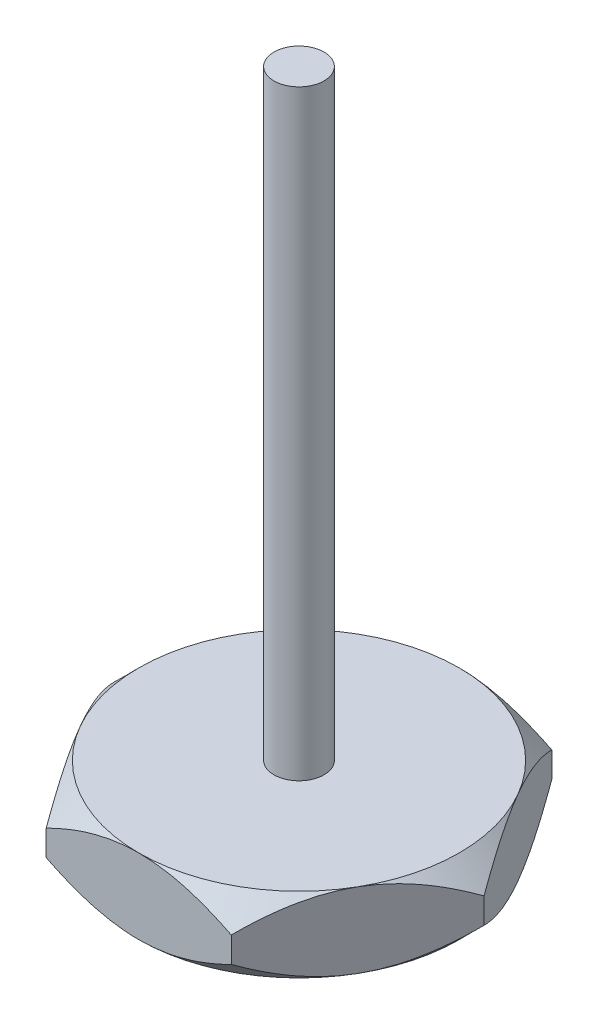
ISO-10303-21;
HEADER;
FILE_DESCRIPTION(('STEP AP214'),'2;1');
FILE_NAME('part.step','',(''),(''),'','','');
FILE_SCHEMA(('AUTOMOTIVE_DESIGN { 1 0 10303 214 1 1 1 1 }'));
ENDSEC;
DATA;
#1=APPLICATION_CONTEXT('core data for automotive mechanical design processes');
#2=APPLICATION_PROTOCOL_DEFINITION('international standard','automotive_design',2000,#1);
#3=PRODUCT_CONTEXT('',#1,'mechanical');
#4=PRODUCT('Part','Part','',(#3));
#5=PRODUCT_RELATED_PRODUCT_CATEGORY('part','',(#4));
#6=PRODUCT_DEFINITION_FORMATION('','',#4);
#7=PRODUCT_DEFINITION_CONTEXT('part definition',#1,'design');
#8=PRODUCT_DEFINITION('design','',#6,#7);
#9=PRODUCT_DEFINITION_SHAPE('','',#8);
#10=(LENGTH_UNIT() NAMED_UNIT(*) SI_UNIT(.MILLI.,.METRE.));
#11=(NAMED_UNIT(*) PLANE_ANGLE_UNIT() SI_UNIT($,.RADIAN.));
#12=(NAMED_UNIT(*) SI_UNIT($,.STERADIAN.) SOLID_ANGLE_UNIT());
#13=UNCERTAINTY_MEASURE_WITH_UNIT(LENGTH_MEASURE(1.E-05),#10,'distance_accuracy_value','');
#14=(GEOMETRIC_REPRESENTATION_CONTEXT(3) GLOBAL_UNCERTAINTY_ASSIGNED_CONTEXT((#13)) GLOBAL_UNIT_ASSIGNED_CONTEXT((#10,
#11,#12)) REPRESENTATION_CONTEXT('',''));
#15=CARTESIAN_POINT('',(0.,0.,0.));
#16=DIRECTION('',(0.,0.,1.));
#17=DIRECTION('',(1.,0.,0.));
#18=AXIS2_PLACEMENT_3D('',#15,#16,#17);
#19=CARTESIAN_POINT('',(4.618802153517,1.875,-8.));
#20=DIRECTION('',(0.,0.,1.));
#21=DIRECTION('',(1.,0.,0.));
#22=AXIS2_PLACEMENT_3D('',#19,#20,#21);
#23=PLANE('',#22);
#24=DIRECTION('',(0.,-1.,0.));
#25=VECTOR('',#24,1.);
#26=CARTESIAN_POINT('',(4.618802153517,1.875,-8.));
#27=LINE('',#26,#25);
#28=CARTESIAN_POINT('',(4.618802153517,0.637395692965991,-8.));
#29=VERTEX_POINT('',#28);
#30=CARTESIAN_POINT('',(4.618802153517,-0.637395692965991,-8.));
#31=VERTEX_POINT('',#30);
#32=EDGE_CURVE('E254',#29,#31,#27,.T.);
#33=ORIENTED_EDGE('',*,*,#32,.T.);
#34=CARTESIAN_POINT('',(14.5887480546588,6.76325621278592,-8.));
#35=CARTESIAN_POINT('',(14.3746791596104,6.57556138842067,-8.));
#36=CARTESIAN_POINT('',(14.1601418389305,6.38840037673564,-8.));
#37=CARTESIAN_POINT('',(13.7300046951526,6.01529729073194,-8.));
#38=CARTESIAN_POINT('',(13.5144048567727,5.8293552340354,-8.));
#39=CARTESIAN_POINT('',(12.865646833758,5.27343359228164,-8.));
#40=CARTESIAN_POINT('',(12.4307136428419,4.90551987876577,-8.));
#41=CARTESIAN_POINT('',(11.5461849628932,4.16967112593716,-8.));
#42=CARTESIAN_POINT('',(11.0964696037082,3.80187951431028,-8.));
#43=CARTESIAN_POINT('',(10.4158587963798,3.25784673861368,-8.));
#44=CARTESIAN_POINT('',(10.1880069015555,3.07779708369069,-8.));
#45=CARTESIAN_POINT('',(9.72996585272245,2.72069873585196,-8.));
#46=CARTESIAN_POINT('',(9.49977673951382,2.54364999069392,-8.));
#47=CARTESIAN_POINT('',(9.03646716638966,2.19292465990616,-8.));
#48=CARTESIAN_POINT('',(8.80334393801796,2.01925172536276,-8.));
#49=CARTESIAN_POINT('',(8.33397268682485,1.67616618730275,-8.));
#50=CARTESIAN_POINT('',(8.09772463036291,1.50675362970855,-8.));
#51=CARTESIAN_POINT('',(7.6214106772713,1.17294130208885,-8.));
#52=CARTESIAN_POINT('',(7.38134177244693,1.00854581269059,-8.));
#53=CARTESIAN_POINT('',(6.89699977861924,0.68605811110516,-8.));
#54=CARTESIAN_POINT('',(6.65272678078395,0.527965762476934,-8.));
#55=CARTESIAN_POINT('',(6.16073953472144,0.220446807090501,-8.));
#56=CARTESIAN_POINT('',(5.91305359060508,0.0709751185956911,-8.));
#57=CARTESIAN_POINT('',(5.41210630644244,-0.218443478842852,-8.));
#58=CARTESIAN_POINT('',(5.1588442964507,-0.358389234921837,-8.));
#59=CARTESIAN_POINT('',(4.64638535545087,-0.626149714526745,-8.));
#60=CARTESIAN_POINT('',(4.38719712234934,-0.753980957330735,-8.));
#61=CARTESIAN_POINT('',(3.86200268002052,-0.994649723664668,-8.));
#62=CARTESIAN_POINT('',(3.59599907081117,-1.10749286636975,-8.));
#63=CARTESIAN_POINT('',(3.05047084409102,-1.31693265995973,-8.));
#64=CARTESIAN_POINT('',(2.77077569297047,-1.41309128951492,-8.));
#65=CARTESIAN_POINT('',(2.20415460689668,-1.58131467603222,-8.));
#66=CARTESIAN_POINT('',(1.91722981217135,-1.65338320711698,-8.));
#67=CARTESIAN_POINT('',(1.33977169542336,-1.76847996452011,-8.));
#68=CARTESIAN_POINT('',(1.04928260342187,-1.81172554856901,-8.));
#69=CARTESIAN_POINT('',(0.465319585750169,-1.86674621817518,-8.));
#70=CARTESIAN_POINT('',(0.171846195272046,-1.87852684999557,-8.));
#71=CARTESIAN_POINT('',(-0.415822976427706,-1.86961316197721,-8.));
#72=CARTESIAN_POINT('',(-0.710016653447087,-1.8487829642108,-8.));
#73=CARTESIAN_POINT('',(-1.29452867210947,-1.77613713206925,-8.));
#74=CARTESIAN_POINT('',(-1.58484610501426,-1.72431435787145,-8.));
#75=CARTESIAN_POINT('',(-2.16150815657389,-1.59293897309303,-8.));
#76=CARTESIAN_POINT('',(-2.44780095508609,-1.51316331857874,-8.));
#77=CARTESIAN_POINT('',(-3.0128630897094,-1.33065876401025,-8.));
#78=CARTESIAN_POINT('',(-3.29163196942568,-1.22792847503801,-8.));
#79=CARTESIAN_POINT('',(-3.88571971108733,-0.986030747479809,-8.));
#80=CARTESIAN_POINT('',(-4.19972130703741,-0.843661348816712,-8.));
#81=CARTESIAN_POINT('',(-4.81844629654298,-0.539865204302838,-8.));
#82=CARTESIAN_POINT('',(-5.12316440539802,-0.378427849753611,-8.));
#83=CARTESIAN_POINT('',(-5.72498623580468,-0.0407063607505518,-8.));
#84=CARTESIAN_POINT('',(-6.02207363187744,0.135606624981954,-8.));
#85=CARTESIAN_POINT('',(-6.60919613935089,0.499411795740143,-8.));
#86=CARTESIAN_POINT('',(-6.89923258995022,0.686901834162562,-8.));
#87=CARTESIAN_POINT('',(-7.47503738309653,1.0716926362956,-8.));
#88=CARTESIAN_POINT('',(-7.76077290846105,1.26904227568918,-8.));
#89=CARTESIAN_POINT('',(-8.32728717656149,1.67072804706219,-8.));
#90=CARTESIAN_POINT('',(-8.6080657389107,1.87506443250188,-8.));
#91=CARTESIAN_POINT('',(-9.16514130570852,2.28909222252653,-8.));
#92=CARTESIAN_POINT('',(-9.44144302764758,2.49877729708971,-8.));
#93=CARTESIAN_POINT('',(-9.99053710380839,2.92267184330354,-8.));
#94=CARTESIAN_POINT('',(-10.2633295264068,3.13688122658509,-8.));
#95=CARTESIAN_POINT('',(-10.8823031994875,3.62982343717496,-8.));
#96=CARTESIAN_POINT('',(-11.2275330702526,3.90974962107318,-8.));
#97=CARTESIAN_POINT('',(-11.9140938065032,4.47448032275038,-8.));
#98=CARTESIAN_POINT('',(-12.2554238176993,4.75928587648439,-8.));
#99=CARTESIAN_POINT('',(-12.9302824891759,5.32894125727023,-8.));
#100=CARTESIAN_POINT('',(-13.2638544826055,5.61373983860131,-8.));
#101=CARTESIAN_POINT('',(-13.9282286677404,6.18636928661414,-8.));
#102=CARTESIAN_POINT('',(-14.2590315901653,6.47419930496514,-8.));
#103=CARTESIAN_POINT('',(-14.5887480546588,6.76325621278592,-8.));
#104=B_SPLINE_CURVE_WITH_KNOTS('',3,(#34,#35,#36,#37,#38,#39,#40,#41,#42,#43,#44,#45,#46,#47,
#48,#49,#50,#51,#52,#53,#54,#55,#56,#57,#58,#59,#60,#61,#62,#63,#64,#65,#66,#67,#68,#69,#70,#71,
#72,#73,#74,#75,#76,#77,#78,#79,#80,#81,#82,#83,#84,#85,#86,#87,#88,#89,#90,#91,#92,#93,#94,#95,
#96,#97,#98,#99,#100,#101,#102,#103),.UNSPECIFIED.,.F.,.F.,(4,2,2,2,2,2,2,2,2,2,2,2,2,2,2,2,2,2,
2,2,2,2,2,2,2,2,2,2,2,2,2,2,2,2,4),(0.,0.854103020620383,1.7082183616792,3.41718202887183,
5.15993769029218,6.03112936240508,6.9023058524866,7.7743773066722,8.64645815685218,
9.51926337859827,10.3920496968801,11.2597561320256,12.1275673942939,12.9941777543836,
13.8604622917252,14.7468593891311,15.6331175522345,16.5126143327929,17.3919560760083,
18.2749714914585,19.1581904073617,20.0486235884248,20.9391106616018,21.9725609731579,
23.0065889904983,24.0426707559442,25.0785541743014,26.1202137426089,27.1619111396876,
28.2024282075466,29.2429249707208,30.5762391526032,31.909840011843,33.2256554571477,
34.5411119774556),.UNSPECIFIED.);
#105=CARTESIAN_POINT('',(0.,-1.875,-8.));
#106=VERTEX_POINT('',#105);
#107=EDGE_CURVE('E57',#31,#106,#104,.T.);
#108=ORIENTED_EDGE('',*,*,#107,.T.);
#109=CARTESIAN_POINT('',(-4.618802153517,-0.637395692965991,-8.));
#110=VERTEX_POINT('',#109);
#111=EDGE_CURVE('E192',#106,#110,#104,.T.);
#112=ORIENTED_EDGE('',*,*,#111,.T.);
#113=DIRECTION('',(0.,-1.,0.));
#114=VECTOR('',#113,1.);
#115=CARTESIAN_POINT('',(-4.618802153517,1.875,-8.));
#116=LINE('',#115,#114);
#117=CARTESIAN_POINT('',(-4.618802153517,0.637395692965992,-8.));
#118=VERTEX_POINT('',#117);
#119=EDGE_CURVE('E266',#118,#110,#116,.T.);
#120=ORIENTED_EDGE('',*,*,#119,.F.);
#121=CARTESIAN_POINT('',(14.5887480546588,-6.76325621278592,-8.));
#122=CARTESIAN_POINT('',(14.3746791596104,-6.57556138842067,-8.));
#123=CARTESIAN_POINT('',(14.1601418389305,-6.38840037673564,-8.));
#124=CARTESIAN_POINT('',(13.7300046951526,-6.01529729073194,-8.));
#125=CARTESIAN_POINT('',(13.5144048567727,-5.8293552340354,-8.));
#126=CARTESIAN_POINT('',(12.865646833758,-5.27343359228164,-8.));
#127=CARTESIAN_POINT('',(12.4307136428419,-4.90551987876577,-8.));
#128=CARTESIAN_POINT('',(11.5461849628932,-4.16967112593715,-8.));
#129=CARTESIAN_POINT('',(11.0964696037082,-3.80187951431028,-8.));
#130=CARTESIAN_POINT('',(10.4158587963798,-3.25784673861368,-8.));
#131=CARTESIAN_POINT('',(10.1880069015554,-3.07779708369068,-8.));
#132=CARTESIAN_POINT('',(9.72996585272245,-2.72069873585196,-8.));
#133=CARTESIAN_POINT('',(9.49977673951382,-2.54364999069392,-8.));
#134=CARTESIAN_POINT('',(9.03646716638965,-2.19292465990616,-8.));
#135=CARTESIAN_POINT('',(8.80334393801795,-2.01925172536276,-8.));
#136=CARTESIAN_POINT('',(8.33397268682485,-1.67616618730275,-8.));
#137=CARTESIAN_POINT('',(8.09772463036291,-1.50675362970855,-8.));
#138=CARTESIAN_POINT('',(7.62141067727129,-1.17294130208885,-8.));
#139=CARTESIAN_POINT('',(7.38134177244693,-1.00854581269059,-8.));
#140=CARTESIAN_POINT('',(6.89699977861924,-0.686058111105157,-8.));
#141=CARTESIAN_POINT('',(6.65272678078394,-0.527965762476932,-8.));
#142=CARTESIAN_POINT('',(6.16073953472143,-0.220446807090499,-8.));
#143=CARTESIAN_POINT('',(5.91305359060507,-0.0709751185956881,-8.));
#144=CARTESIAN_POINT('',(5.41210630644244,0.218443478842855,-8.));
#145=CARTESIAN_POINT('',(5.15884429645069,0.35838923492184,-8.));
#146=CARTESIAN_POINT('',(4.64638535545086,0.626149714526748,-8.));
#147=CARTESIAN_POINT('',(4.38719712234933,0.753980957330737,-8.));
#148=CARTESIAN_POINT('',(3.86200268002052,0.99464972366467,-8.));
#149=CARTESIAN_POINT('',(3.59599907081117,1.10749286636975,-8.));
#150=CARTESIAN_POINT('',(3.05047084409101,1.31693265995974,-8.));
#151=CARTESIAN_POINT('',(2.77077569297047,1.41309128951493,-8.));
#152=CARTESIAN_POINT('',(2.20415460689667,1.58131467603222,-8.));
#153=CARTESIAN_POINT('',(1.91722981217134,1.65338320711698,-8.));
#154=CARTESIAN_POINT('',(1.33977169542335,1.76847996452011,-8.));
#155=CARTESIAN_POINT('',(1.04928260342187,1.81172554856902,-8.));
#156=CARTESIAN_POINT('',(0.465319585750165,1.86674621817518,-8.));
#157=CARTESIAN_POINT('',(0.171846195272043,1.87852684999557,-8.));
#158=CARTESIAN_POINT('',(-0.41582297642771,1.86961316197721,-8.));
#159=CARTESIAN_POINT('',(-0.71001665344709,1.8487829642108,-8.));
#160=CARTESIAN_POINT('',(-1.29452867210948,1.77613713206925,-8.));
#161=CARTESIAN_POINT('',(-1.58484610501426,1.72431435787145,-8.));
#162=CARTESIAN_POINT('',(-2.16150815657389,1.59293897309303,-8.));
#163=CARTESIAN_POINT('',(-2.44780095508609,1.51316331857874,-8.));
#164=CARTESIAN_POINT('',(-3.0128630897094,1.33065876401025,-8.));
#165=CARTESIAN_POINT('',(-3.29163196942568,1.22792847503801,-8.));
#166=CARTESIAN_POINT('',(-3.88571971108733,0.98603074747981,-8.));
#167=CARTESIAN_POINT('',(-4.19972130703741,0.843661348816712,-8.));
#168=CARTESIAN_POINT('',(-4.81844629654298,0.539865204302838,-8.));
#169=CARTESIAN_POINT('',(-5.12316440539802,0.37842784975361,-8.));
#170=CARTESIAN_POINT('',(-5.72498623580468,0.0407063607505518,-8.));
#171=CARTESIAN_POINT('',(-6.02207363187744,-0.135606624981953,-8.));
#172=CARTESIAN_POINT('',(-6.60919613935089,-0.499411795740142,-8.));
#173=CARTESIAN_POINT('',(-6.89923258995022,-0.686901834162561,-8.));
#174=CARTESIAN_POINT('',(-7.47503738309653,-1.0716926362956,-8.));
#175=CARTESIAN_POINT('',(-7.76077290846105,-1.26904227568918,-8.));
#176=CARTESIAN_POINT('',(-8.32728717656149,-1.67072804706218,-8.));
#177=CARTESIAN_POINT('',(-8.6080657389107,-1.87506443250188,-8.));
#178=CARTESIAN_POINT('',(-9.16514130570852,-2.28909222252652,-8.));
#179=CARTESIAN_POINT('',(-9.44144302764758,-2.49877729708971,-8.));
#180=CARTESIAN_POINT('',(-9.99053710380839,-2.92267184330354,-8.));
#181=CARTESIAN_POINT('',(-10.2633295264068,-3.13688122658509,-8.));
#182=CARTESIAN_POINT('',(-10.8823031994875,-3.62982343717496,-8.));
#183=CARTESIAN_POINT('',(-11.2275330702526,-3.90974962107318,-8.));
#184=CARTESIAN_POINT('',(-11.9140938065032,-4.47448032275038,-8.));
#185=CARTESIAN_POINT('',(-12.2554238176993,-4.75928587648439,-8.));
#186=CARTESIAN_POINT('',(-12.9302824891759,-5.32894125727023,-8.));
#187=CARTESIAN_POINT('',(-13.2638544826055,-5.61373983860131,-8.));
#188=CARTESIAN_POINT('',(-13.9282286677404,-6.18636928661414,-8.));
#189=CARTESIAN_POINT('',(-14.2590315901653,-6.47419930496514,-8.));
#190=CARTESIAN_POINT('',(-14.5887480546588,-6.76325621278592,-8.));
#191=B_SPLINE_CURVE_WITH_KNOTS('',3,(#121,#122,#123,#124,#125,#126,#127,#128,#129,#130,#131,
#132,#133,#134,#135,#136,#137,#138,#139,#140,#141,#142,#143,#144,#145,#146,#147,#148,#149,#150,
#151,#152,#153,#154,#155,#156,#157,#158,#159,#160,#161,#162,#163,#164,#165,#166,#167,#168,#169,
#170,#171,#172,#173,#174,#175,#176,#177,#178,#179,#180,#181,#182,#183,#184,#185,#186,#187,#188,
#189,#190),.UNSPECIFIED.,.F.,.F.,(4,2,2,2,2,2,2,2,2,2,2,2,2,2,2,2,2,2,2,2,2,2,2,2,2,2,2,2,2,2,2,
2,2,2,4),(0.,0.854103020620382,1.7082183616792,3.41718202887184,5.15993769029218,
6.03112936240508,6.90230585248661,7.7743773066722,8.64645815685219,9.51926337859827,
10.3920496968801,11.2597561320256,12.1275673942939,12.9941777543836,13.8604622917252,
14.7468593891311,15.6331175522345,16.5126143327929,17.3919560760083,18.2749714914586,
19.1581904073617,20.0486235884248,20.9391106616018,21.9725609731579,23.0065889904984,
24.0426707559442,25.0785541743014,26.1202137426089,27.1619111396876,28.2024282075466,
29.2429249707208,30.5762391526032,31.909840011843,33.2256554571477,34.5411119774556),.UNSPECIFIED.);
#192=CARTESIAN_POINT('',(0.,1.875,-8.));
#193=VERTEX_POINT('',#192);
#194=EDGE_CURVE('E247',#193,#118,#191,.T.);
#195=ORIENTED_EDGE('',*,*,#194,.F.);
#196=EDGE_CURVE('E253',#29,#193,#191,.T.);
#197=ORIENTED_EDGE('',*,*,#196,.F.);
#198=EDGE_LOOP('',(#33,#108,#112,#120,#195,#197));
#199=FACE_BOUND('',#198,.T.);
#200=ADVANCED_FACE('F35',(#199),#23,.F.);
#201=CARTESIAN_POINT('',(-4.618802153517,1.875,-8.));
#202=DIRECTION('',(0.866025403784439,0.,0.5));
#203=DIRECTION('',(0.5,0.,-0.866025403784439));
#204=AXIS2_PLACEMENT_3D('',#201,#202,#203);
#205=PLANE('',#204);
#206=ORIENTED_EDGE('',*,*,#119,.T.);
#207=CARTESIAN_POINT('',(-4.61868668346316,-0.637280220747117,-8.0002));
#208=CARTESIAN_POINT('',(-4.6981028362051,-0.716687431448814,-7.86264718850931));
#209=CARTESIAN_POINT('',(-4.77812941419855,-0.793657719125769,-7.72403708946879));
#210=CARTESIAN_POINT('',(-4.93952317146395,-0.941983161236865,-7.44449490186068));
#211=CARTESIAN_POINT('',(-5.02089105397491,-1.01333524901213,-7.30356159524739));
#212=CARTESIAN_POINT('',(-5.26794216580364,-1.21846070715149,-6.87565651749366));
#213=CARTESIAN_POINT('',(-5.43571676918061,-1.34242824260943,-6.58506238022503));
#214=CARTESIAN_POINT('',(-5.77404764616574,-1.5547139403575,-5.99905611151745));
#215=CARTESIAN_POINT('',(-5.94451745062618,-1.6435669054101,-5.70379374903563));
#216=CARTESIAN_POINT('',(-6.2030246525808,-1.74634783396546,-5.25604614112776));
#217=CARTESIAN_POINT('',(-6.28957430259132,-1.77551131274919,-5.10613774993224));
#218=CARTESIAN_POINT('',(-6.46340640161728,-1.82301217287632,-4.80505172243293));
#219=CARTESIAN_POINT('',(-6.55068873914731,-1.84135117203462,-4.65387427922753));
#220=CARTESIAN_POINT('',(-6.76338552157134,-1.87209931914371,-4.2854726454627));
#221=CARTESIAN_POINT('',(-6.88902914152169,-1.87855065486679,-4.06785151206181));
#222=CARTESIAN_POINT('',(-7.14008990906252,-1.8677210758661,-3.63300150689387));
#223=CARTESIAN_POINT('',(-7.26550696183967,-1.85043184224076,-3.41577279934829));
#224=CARTESIAN_POINT('',(-7.51515863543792,-1.79314025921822,-2.98336341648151));
#225=CARTESIAN_POINT('',(-7.63939177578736,-1.75311251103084,-2.76818530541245));
#226=CARTESIAN_POINT('',(-7.8857227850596,-1.65252005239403,-2.34152748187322));
#227=CARTESIAN_POINT('',(-8.00782081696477,-1.59195691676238,-2.13004748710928));
#228=CARTESIAN_POINT('',(-8.22456323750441,-1.4673620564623,-1.75463860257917));
#229=CARTESIAN_POINT('',(-8.31968762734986,-1.40660757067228,-1.58987832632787));
#230=CARTESIAN_POINT('',(-8.50822887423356,-1.27530853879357,-1.2633153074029));
#231=CARTESIAN_POINT('',(-8.60164567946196,-1.20476369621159,-1.10151265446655));
#232=CARTESIAN_POINT('',(-8.78647752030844,-1.05546522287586,-0.781374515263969));
#233=CARTESIAN_POINT('',(-8.87789781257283,-0.976737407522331,-0.623029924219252));
#234=CARTESIAN_POINT('',(-9.05904561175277,-0.812106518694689,-0.30927273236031));
#235=CARTESIAN_POINT('',(-9.14877411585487,-0.726207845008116,-0.153858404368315));
#236=CARTESIAN_POINT('',(-9.23771977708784,-0.637280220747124,0.000200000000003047));
#237=B_SPLINE_CURVE_WITH_KNOTS('',3,(#207,#208,#209,#210,#211,#212,#213,#214,#215,#216,#217,
#218,#219,#220,#221,#222,#223,#224,#225,#226,#227,#228,#229,#230,#231,#232,#233,#234,#235,#236),
.UNSPECIFIED.,.F.,.F.,(4,2,2,2,2,2,2,2,2,2,2,2,2,2,4),(0.,0.532696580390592,1.06568194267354,
2.13740664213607,3.19211397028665,3.71843331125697,4.24467396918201,4.99761238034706,
5.75081469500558,6.50485999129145,7.25884747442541,7.85770857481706,8.4565878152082,
9.05363199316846,9.65031250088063),.UNSPECIFIED.);
#238=CARTESIAN_POINT('',(-6.92820323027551,-1.875,-3.99999999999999));
#239=VERTEX_POINT('',#238);
#240=EDGE_CURVE('E352',#110,#239,#237,.T.);
#241=ORIENTED_EDGE('',*,*,#240,.T.);
#242=CARTESIAN_POINT('',(-9.237604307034,-0.637395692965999,0.));
#243=VERTEX_POINT('',#242);
#244=EDGE_CURVE('E210',#239,#243,#237,.T.);
#245=ORIENTED_EDGE('',*,*,#244,.T.);
#246=DIRECTION('',(0.,-1.,0.));
#247=VECTOR('',#246,1.);
#248=CARTESIAN_POINT('',(-9.237604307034,1.875,0.));
#249=LINE('',#248,#247);
#250=CARTESIAN_POINT('',(-9.237604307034,0.637395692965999,0.));
#251=VERTEX_POINT('',#250);
#252=EDGE_CURVE('E263',#251,#243,#249,.T.);
#253=ORIENTED_EDGE('',*,*,#252,.F.);
#254=CARTESIAN_POINT('',(-4.61868668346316,0.637280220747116,-8.0002));
#255=CARTESIAN_POINT('',(-4.6981028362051,0.716687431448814,-7.86264718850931));
#256=CARTESIAN_POINT('',(-4.77812941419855,0.793657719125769,-7.72403708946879));
#257=CARTESIAN_POINT('',(-4.93952317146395,0.941983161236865,-7.44449490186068));
#258=CARTESIAN_POINT('',(-5.02089105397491,1.01333524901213,-7.30356159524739));
#259=CARTESIAN_POINT('',(-5.26794216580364,1.21846070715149,-6.87565651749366));
#260=CARTESIAN_POINT('',(-5.43571676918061,1.34242824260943,-6.58506238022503));
#261=CARTESIAN_POINT('',(-5.77404764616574,1.5547139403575,-5.99905611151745));
#262=CARTESIAN_POINT('',(-5.94451745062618,1.6435669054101,-5.70379374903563));
#263=CARTESIAN_POINT('',(-6.2030246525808,1.74634783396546,-5.25604614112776));
#264=CARTESIAN_POINT('',(-6.28957430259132,1.77551131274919,-5.10613774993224));
#265=CARTESIAN_POINT('',(-6.46340640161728,1.82301217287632,-4.80505172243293));
#266=CARTESIAN_POINT('',(-6.55068873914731,1.84135117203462,-4.65387427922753));
#267=CARTESIAN_POINT('',(-6.76338552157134,1.87209931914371,-4.2854726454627));
#268=CARTESIAN_POINT('',(-6.88902914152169,1.87855065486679,-4.06785151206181));
#269=CARTESIAN_POINT('',(-7.14008990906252,1.8677210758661,-3.63300150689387));
#270=CARTESIAN_POINT('',(-7.26550696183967,1.85043184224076,-3.41577279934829));
#271=CARTESIAN_POINT('',(-7.51515863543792,1.79314025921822,-2.98336341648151));
#272=CARTESIAN_POINT('',(-7.63939177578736,1.75311251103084,-2.76818530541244));
#273=CARTESIAN_POINT('',(-7.8857227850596,1.65252005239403,-2.34152748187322));
#274=CARTESIAN_POINT('',(-8.00782081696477,1.59195691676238,-2.13004748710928));
#275=CARTESIAN_POINT('',(-8.22456323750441,1.4673620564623,-1.75463860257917));
#276=CARTESIAN_POINT('',(-8.31968762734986,1.40660757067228,-1.58987832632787));
#277=CARTESIAN_POINT('',(-8.50822887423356,1.27530853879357,-1.2633153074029));
#278=CARTESIAN_POINT('',(-8.60164567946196,1.20476369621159,-1.10151265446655));
#279=CARTESIAN_POINT('',(-8.78647752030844,1.05546522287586,-0.78137451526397));
#280=CARTESIAN_POINT('',(-8.87789781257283,0.97673740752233,-0.623029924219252));
#281=CARTESIAN_POINT('',(-9.05904561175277,0.812106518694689,-0.30927273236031));
#282=CARTESIAN_POINT('',(-9.14877411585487,0.726207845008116,-0.153858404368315));
#283=CARTESIAN_POINT('',(-9.23771977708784,0.637280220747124,0.000200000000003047));
#284=B_SPLINE_CURVE_WITH_KNOTS('',3,(#254,#255,#256,#257,#258,#259,#260,#261,#262,#263,#264,
#265,#266,#267,#268,#269,#270,#271,#272,#273,#274,#275,#276,#277,#278,#279,#280,#281,#282,#283),
.UNSPECIFIED.,.F.,.F.,(4,2,2,2,2,2,2,2,2,2,2,2,2,2,4),(0.,0.532696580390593,1.06568194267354,
2.13740664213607,3.19211397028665,3.71843331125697,4.24467396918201,4.99761238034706,
5.75081469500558,6.50485999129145,7.25884747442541,7.85770857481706,8.4565878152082,
9.05363199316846,9.65031250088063),.UNSPECIFIED.);
#285=CARTESIAN_POINT('',(-6.92820323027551,1.875,-3.99999999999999));
#286=VERTEX_POINT('',#285);
#287=EDGE_CURVE('E240',#286,#251,#284,.T.);
#288=ORIENTED_EDGE('',*,*,#287,.F.);
#289=EDGE_CURVE('E246',#118,#286,#284,.T.);
#290=ORIENTED_EDGE('',*,*,#289,.F.);
#291=EDGE_LOOP('',(#206,#241,#245,#253,#288,#290));
#292=FACE_BOUND('',#291,.T.);
#293=ADVANCED_FACE('F219',(#292),#205,.F.);
#294=CARTESIAN_POINT('',(-9.237604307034,1.875,0.));
#295=DIRECTION('',(0.866025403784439,0.,-0.5));
#296=DIRECTION('',(-0.5,0.,-0.866025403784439));
#297=AXIS2_PLACEMENT_3D('',#294,#295,#296);
#298=PLANE('',#297);
#299=ORIENTED_EDGE('',*,*,#252,.T.);
#300=CARTESIAN_POINT('',(-9.23771977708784,-0.637280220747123,-0.000199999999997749));
#301=CARTESIAN_POINT('',(-9.15830362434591,-0.71668743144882,0.137352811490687));
#302=CARTESIAN_POINT('',(-9.07827704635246,-0.793657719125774,0.275962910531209));
#303=CARTESIAN_POINT('',(-8.91688328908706,-0.94198316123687,0.555505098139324));
#304=CARTESIAN_POINT('',(-8.8355154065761,-1.01333524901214,0.696438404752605));
#305=CARTESIAN_POINT('',(-8.58846429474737,-1.2184607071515,1.12434348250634));
#306=CARTESIAN_POINT('',(-8.4206896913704,-1.34242824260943,1.41493761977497));
#307=CARTESIAN_POINT('',(-8.08235881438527,-1.5547139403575,2.00094388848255));
#308=CARTESIAN_POINT('',(-7.91188900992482,-1.64356690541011,2.29620625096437));
#309=CARTESIAN_POINT('',(-7.65338180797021,-1.74634783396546,2.74395385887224));
#310=CARTESIAN_POINT('',(-7.56683215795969,-1.77551131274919,2.89386225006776));
#311=CARTESIAN_POINT('',(-7.39300005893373,-1.82301217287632,3.19494827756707));
#312=CARTESIAN_POINT('',(-7.3057177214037,-1.84135117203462,3.34612572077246));
#313=CARTESIAN_POINT('',(-7.09302093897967,-1.87209931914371,3.7145273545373));
#314=CARTESIAN_POINT('',(-6.96737731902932,-1.87855065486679,3.93214848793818));
#315=CARTESIAN_POINT('',(-6.71631655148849,-1.8677210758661,4.36699849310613));
#316=CARTESIAN_POINT('',(-6.59089949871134,-1.85043184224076,4.5842272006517));
#317=CARTESIAN_POINT('',(-6.34124782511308,-1.79314025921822,5.01663658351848));
#318=CARTESIAN_POINT('',(-6.21701468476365,-1.75311251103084,5.23181469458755));
#319=CARTESIAN_POINT('',(-5.97068367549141,-1.65252005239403,5.65847251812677));
#320=CARTESIAN_POINT('',(-5.84858564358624,-1.59195691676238,5.86995251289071));
#321=CARTESIAN_POINT('',(-5.6318432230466,-1.4673620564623,6.24536139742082));
#322=CARTESIAN_POINT('',(-5.53671883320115,-1.40660757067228,6.41012167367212));
#323=CARTESIAN_POINT('',(-5.34817758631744,-1.27530853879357,6.73668469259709));
#324=CARTESIAN_POINT('',(-5.25476078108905,-1.20476369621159,6.89848734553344));
#325=CARTESIAN_POINT('',(-5.06992894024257,-1.05546522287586,7.21862548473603));
#326=CARTESIAN_POINT('',(-4.97850864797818,-0.976737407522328,7.37697007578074));
#327=CARTESIAN_POINT('',(-4.79736084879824,-0.812106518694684,7.69072726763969));
#328=CARTESIAN_POINT('',(-4.70763234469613,-0.72620784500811,7.84614159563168));
#329=CARTESIAN_POINT('',(-4.61868668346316,-0.637280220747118,8.0002));
#330=B_SPLINE_CURVE_WITH_KNOTS('',3,(#300,#301,#302,#303,#304,#305,#306,#307,#308,#309,#310,
#311,#312,#313,#314,#315,#316,#317,#318,#319,#320,#321,#322,#323,#324,#325,#326,#327,#328,#329),
.UNSPECIFIED.,.F.,.F.,(4,2,2,2,2,2,2,2,2,2,2,2,2,2,4),(0.,0.532696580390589,1.06568194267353,
2.13740664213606,3.19211397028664,3.71843331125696,4.244673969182,4.99761238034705,
5.75081469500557,6.50485999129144,7.2588474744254,7.85770857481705,8.4565878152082,
9.05363199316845,9.65031250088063),.UNSPECIFIED.);
#331=CARTESIAN_POINT('',(-6.92820323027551,-1.875,4.));
#332=VERTEX_POINT('',#331);
#333=EDGE_CURVE('E209',#243,#332,#330,.T.);
#334=ORIENTED_EDGE('',*,*,#333,.T.);
#335=CARTESIAN_POINT('',(-4.618802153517,-0.637395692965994,8.));
#336=VERTEX_POINT('',#335);
#337=EDGE_CURVE('E202',#332,#336,#330,.T.);
#338=ORIENTED_EDGE('',*,*,#337,.T.);
#339=DIRECTION('',(0.,-1.,0.));
#340=VECTOR('',#339,1.);
#341=CARTESIAN_POINT('',(-4.618802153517,1.875,8.));
#342=LINE('',#341,#340);
#343=CARTESIAN_POINT('',(-4.618802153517,0.637395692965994,8.));
#344=VERTEX_POINT('',#343);
#345=EDGE_CURVE('E260',#344,#336,#342,.T.);
#346=ORIENTED_EDGE('',*,*,#345,.F.);
#347=CARTESIAN_POINT('',(-9.23771977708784,0.637280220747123,-0.000199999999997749));
#348=CARTESIAN_POINT('',(-9.15830362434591,0.71668743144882,0.137352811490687));
#349=CARTESIAN_POINT('',(-9.07827704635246,0.793657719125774,0.275962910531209));
#350=CARTESIAN_POINT('',(-8.91688328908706,0.94198316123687,0.555505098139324));
#351=CARTESIAN_POINT('',(-8.8355154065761,1.01333524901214,0.696438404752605));
#352=CARTESIAN_POINT('',(-8.58846429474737,1.2184607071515,1.12434348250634));
#353=CARTESIAN_POINT('',(-8.4206896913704,1.34242824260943,1.41493761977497));
#354=CARTESIAN_POINT('',(-8.08235881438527,1.5547139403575,2.00094388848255));
#355=CARTESIAN_POINT('',(-7.91188900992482,1.64356690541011,2.29620625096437));
#356=CARTESIAN_POINT('',(-7.65338180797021,1.74634783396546,2.74395385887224));
#357=CARTESIAN_POINT('',(-7.56683215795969,1.77551131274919,2.89386225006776));
#358=CARTESIAN_POINT('',(-7.39300005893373,1.82301217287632,3.19494827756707));
#359=CARTESIAN_POINT('',(-7.3057177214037,1.84135117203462,3.34612572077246));
#360=CARTESIAN_POINT('',(-7.09302093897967,1.87209931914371,3.7145273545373));
#361=CARTESIAN_POINT('',(-6.96737731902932,1.87855065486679,3.93214848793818));
#362=CARTESIAN_POINT('',(-6.71631655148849,1.8677210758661,4.36699849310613));
#363=CARTESIAN_POINT('',(-6.59089949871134,1.85043184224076,4.5842272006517));
#364=CARTESIAN_POINT('',(-6.34124782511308,1.79314025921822,5.01663658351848));
#365=CARTESIAN_POINT('',(-6.21701468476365,1.75311251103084,5.23181469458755));
#366=CARTESIAN_POINT('',(-5.97068367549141,1.65252005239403,5.65847251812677));
#367=CARTESIAN_POINT('',(-5.84858564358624,1.59195691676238,5.86995251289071));
#368=CARTESIAN_POINT('',(-5.6318432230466,1.4673620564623,6.24536139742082));
#369=CARTESIAN_POINT('',(-5.53671883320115,1.40660757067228,6.41012167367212));
#370=CARTESIAN_POINT('',(-5.34817758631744,1.27530853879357,6.73668469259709));
#371=CARTESIAN_POINT('',(-5.25476078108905,1.20476369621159,6.89848734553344));
#372=CARTESIAN_POINT('',(-5.06992894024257,1.05546522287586,7.21862548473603));
#373=CARTESIAN_POINT('',(-4.97850864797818,0.976737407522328,7.37697007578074));
#374=CARTESIAN_POINT('',(-4.79736084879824,0.812106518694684,7.69072726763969));
#375=CARTESIAN_POINT('',(-4.70763234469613,0.72620784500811,7.84614159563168));
#376=CARTESIAN_POINT('',(-4.61868668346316,0.637280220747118,8.0002));
#377=B_SPLINE_CURVE_WITH_KNOTS('',3,(#347,#348,#349,#350,#351,#352,#353,#354,#355,#356,#357,
#358,#359,#360,#361,#362,#363,#364,#365,#366,#367,#368,#369,#370,#371,#372,#373,#374,#375,#376),
.UNSPECIFIED.,.F.,.F.,(4,2,2,2,2,2,2,2,2,2,2,2,2,2,4),(0.,0.532696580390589,1.06568194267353,
2.13740664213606,3.19211397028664,3.71843331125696,4.244673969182,4.99761238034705,
5.75081469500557,6.50485999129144,7.2588474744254,7.85770857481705,8.4565878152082,
9.05363199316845,9.65031250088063),.UNSPECIFIED.);
#378=CARTESIAN_POINT('',(-6.92820323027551,1.875,4.));
#379=VERTEX_POINT('',#378);
#380=EDGE_CURVE('E225',#379,#344,#377,.T.);
#381=ORIENTED_EDGE('',*,*,#380,.F.);
#382=EDGE_CURVE('E232',#251,#379,#377,.T.);
#383=ORIENTED_EDGE('',*,*,#382,.F.);
#384=EDGE_LOOP('',(#299,#334,#338,#346,#381,#383));
#385=FACE_BOUND('',#384,.T.);
#386=ADVANCED_FACE('F215',(#385),#298,.F.);
#387=CARTESIAN_POINT('',(-4.618802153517,1.875,8.));
#388=DIRECTION('',(0.,0.,-1.));
#389=DIRECTION('',(-1.,0.,0.));
#390=AXIS2_PLACEMENT_3D('',#387,#388,#389);
#391=PLANE('',#390);
#392=ORIENTED_EDGE('',*,*,#345,.T.);
#393=CARTESIAN_POINT('',(-14.5887480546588,6.76325621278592,8.));
#394=CARTESIAN_POINT('',(-14.3746791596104,6.57556138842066,8.));
#395=CARTESIAN_POINT('',(-14.1601418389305,6.38840037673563,8.));
#396=CARTESIAN_POINT('',(-13.7300046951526,6.01529729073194,8.));
#397=CARTESIAN_POINT('',(-13.5144048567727,5.8293552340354,8.));
#398=CARTESIAN_POINT('',(-12.865646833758,5.27343359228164,8.));
#399=CARTESIAN_POINT('',(-12.4307136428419,4.90551987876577,8.));
#400=CARTESIAN_POINT('',(-11.5461849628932,4.16967112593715,8.));
#401=CARTESIAN_POINT('',(-11.0964696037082,3.80187951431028,8.));
#402=CARTESIAN_POINT('',(-10.4158587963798,3.25784673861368,8.));
#403=CARTESIAN_POINT('',(-10.1880069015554,3.07779708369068,8.));
#404=CARTESIAN_POINT('',(-9.72996585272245,2.72069873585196,8.));
#405=CARTESIAN_POINT('',(-9.49977673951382,2.54364999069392,8.));
#406=CARTESIAN_POINT('',(-9.03646716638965,2.19292465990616,8.));
#407=CARTESIAN_POINT('',(-8.80334393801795,2.01925172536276,8.));
#408=CARTESIAN_POINT('',(-8.33397268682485,1.67616618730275,8.));
#409=CARTESIAN_POINT('',(-8.09772463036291,1.50675362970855,8.));
#410=CARTESIAN_POINT('',(-7.62141067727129,1.17294130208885,8.));
#411=CARTESIAN_POINT('',(-7.38134177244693,1.00854581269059,8.));
#412=CARTESIAN_POINT('',(-6.89699977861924,0.686058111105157,8.));
#413=CARTESIAN_POINT('',(-6.65272678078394,0.527965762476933,8.));
#414=CARTESIAN_POINT('',(-6.16073953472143,0.220446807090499,8.));
#415=CARTESIAN_POINT('',(-5.91305359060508,0.0709751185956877,8.));
#416=CARTESIAN_POINT('',(-5.41210630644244,-0.218443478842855,8.));
#417=CARTESIAN_POINT('',(-5.1588442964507,-0.358389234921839,8.));
#418=CARTESIAN_POINT('',(-4.64638535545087,-0.626149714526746,8.));
#419=CARTESIAN_POINT('',(-4.38719712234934,-0.753980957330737,8.));
#420=CARTESIAN_POINT('',(-3.86200268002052,-0.994649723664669,8.));
#421=CARTESIAN_POINT('',(-3.59599907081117,-1.10749286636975,8.));
#422=CARTESIAN_POINT('',(-3.05047084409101,-1.31693265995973,8.));
#423=CARTESIAN_POINT('',(-2.77077569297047,-1.41309128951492,8.));
#424=CARTESIAN_POINT('',(-2.20415460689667,-1.58131467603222,8.));
#425=CARTESIAN_POINT('',(-1.91722981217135,-1.65338320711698,8.));
#426=CARTESIAN_POINT('',(-1.33977169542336,-1.76847996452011,8.));
#427=CARTESIAN_POINT('',(-1.04928260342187,-1.81172554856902,8.));
#428=CARTESIAN_POINT('',(-0.465319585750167,-1.86674621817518,8.));
#429=CARTESIAN_POINT('',(-0.171846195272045,-1.87852684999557,8.));
#430=CARTESIAN_POINT('',(0.415822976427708,-1.86961316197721,8.));
#431=CARTESIAN_POINT('',(0.710016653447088,-1.8487829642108,8.));
#432=CARTESIAN_POINT('',(1.29452867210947,-1.77613713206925,8.));
#433=CARTESIAN_POINT('',(1.58484610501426,-1.72431435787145,8.));
#434=CARTESIAN_POINT('',(2.16150815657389,-1.59293897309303,8.));
#435=CARTESIAN_POINT('',(2.44780095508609,-1.51316331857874,8.));
#436=CARTESIAN_POINT('',(3.0128630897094,-1.33065876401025,8.));
#437=CARTESIAN_POINT('',(3.29163196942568,-1.22792847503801,8.));
#438=CARTESIAN_POINT('',(3.88571971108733,-0.986030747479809,8.));
#439=CARTESIAN_POINT('',(4.19972130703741,-0.843661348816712,8.));
#440=CARTESIAN_POINT('',(4.81844629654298,-0.539865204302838,8.));
#441=CARTESIAN_POINT('',(5.12316440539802,-0.37842784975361,8.));
#442=CARTESIAN_POINT('',(5.72498623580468,-0.0407063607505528,8.));
#443=CARTESIAN_POINT('',(6.02207363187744,0.135606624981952,8.));
#444=CARTESIAN_POINT('',(6.60919613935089,0.499411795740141,8.));
#445=CARTESIAN_POINT('',(6.89923258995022,0.686901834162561,8.));
#446=CARTESIAN_POINT('',(7.47503738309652,1.0716926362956,8.));
#447=CARTESIAN_POINT('',(7.76077290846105,1.26904227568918,8.));
#448=CARTESIAN_POINT('',(8.32728717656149,1.67072804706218,8.));
#449=CARTESIAN_POINT('',(8.6080657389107,1.87506443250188,8.));
#450=CARTESIAN_POINT('',(9.16514130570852,2.28909222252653,8.));
#451=CARTESIAN_POINT('',(9.44144302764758,2.49877729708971,8.));
#452=CARTESIAN_POINT('',(9.99053710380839,2.92267184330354,8.));
#453=CARTESIAN_POINT('',(10.2633295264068,3.13688122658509,8.));
#454=CARTESIAN_POINT('',(10.8823031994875,3.62982343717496,8.));
#455=CARTESIAN_POINT('',(11.2275330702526,3.90974962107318,8.));
#456=CARTESIAN_POINT('',(11.9140938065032,4.47448032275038,8.));
#457=CARTESIAN_POINT('',(12.2554238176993,4.7592858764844,8.));
#458=CARTESIAN_POINT('',(12.9302824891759,5.32894125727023,8.));
#459=CARTESIAN_POINT('',(13.2638544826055,5.61373983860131,8.));
#460=CARTESIAN_POINT('',(13.9282286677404,6.18636928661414,8.));
#461=CARTESIAN_POINT('',(14.2590315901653,6.47419930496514,8.));
#462=CARTESIAN_POINT('',(14.5887480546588,6.76325621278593,8.));
#463=B_SPLINE_CURVE_WITH_KNOTS('',3,(#393,#394,#395,#396,#397,#398,#399,#400,#401,#402,#403,
#404,#405,#406,#407,#408,#409,#410,#411,#412,#413,#414,#415,#416,#417,#418,#419,#420,#421,#422,
#423,#424,#425,#426,#427,#428,#429,#430,#431,#432,#433,#434,#435,#436,#437,#438,#439,#440,#441,
#442,#443,#444,#445,#446,#447,#448,#449,#450,#451,#452,#453,#454,#455,#456,#457,#458,#459,#460,
#461,#462),.UNSPECIFIED.,.F.,.F.,(4,2,2,2,2,2,2,2,2,2,2,2,2,2,2,2,2,2,2,2,2,2,2,2,2,2,2,2,2,2,2,
2,2,2,4),(0.,0.854103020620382,1.7082183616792,3.41718202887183,5.15993769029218,
6.03112936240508,6.9023058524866,7.7743773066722,8.64645815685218,9.51926337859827,
10.3920496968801,11.2597561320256,12.1275673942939,12.9941777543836,13.8604622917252,
14.7468593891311,15.6331175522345,16.5126143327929,17.3919560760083,18.2749714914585,
19.1581904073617,20.0486235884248,20.9391106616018,21.9725609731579,23.0065889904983,
24.0426707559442,25.0785541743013,26.1202137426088,27.1619111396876,28.2024282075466,
29.2429249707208,30.5762391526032,31.909840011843,33.2256554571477,34.5411119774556),.UNSPECIFIED.);
#464=CARTESIAN_POINT('',(0.,-1.875,8.));
#465=VERTEX_POINT('',#464);
#466=EDGE_CURVE('E157',#336,#465,#463,.T.);
#467=ORIENTED_EDGE('',*,*,#466,.T.);
#468=CARTESIAN_POINT('',(4.61880215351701,-0.63739569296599,8.));
#469=VERTEX_POINT('',#468);
#470=EDGE_CURVE('E142',#465,#469,#463,.T.);
#471=ORIENTED_EDGE('',*,*,#470,.T.);
#472=DIRECTION('',(0.,-1.,0.));
#473=VECTOR('',#472,1.);
#474=CARTESIAN_POINT('',(4.61880215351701,1.875,8.));
#475=LINE('',#474,#473);
#476=CARTESIAN_POINT('',(4.61880215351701,0.63739569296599,8.));
#477=VERTEX_POINT('',#476);
#478=EDGE_CURVE('E156',#477,#469,#475,.T.);
#479=ORIENTED_EDGE('',*,*,#478,.F.);
#480=CARTESIAN_POINT('',(-14.5887480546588,-6.76325621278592,8.));
#481=CARTESIAN_POINT('',(-14.3746791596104,-6.57556138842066,8.));
#482=CARTESIAN_POINT('',(-14.1601418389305,-6.38840037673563,8.));
#483=CARTESIAN_POINT('',(-13.7300046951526,-6.01529729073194,8.));
#484=CARTESIAN_POINT('',(-13.5144048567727,-5.8293552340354,8.));
#485=CARTESIAN_POINT('',(-12.865646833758,-5.27343359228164,8.));
#486=CARTESIAN_POINT('',(-12.4307136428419,-4.90551987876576,8.));
#487=CARTESIAN_POINT('',(-11.5461849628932,-4.16967112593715,8.));
#488=CARTESIAN_POINT('',(-11.0964696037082,-3.80187951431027,8.));
#489=CARTESIAN_POINT('',(-10.4158587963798,-3.25784673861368,8.));
#490=CARTESIAN_POINT('',(-10.1880069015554,-3.07779708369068,8.));
#491=CARTESIAN_POINT('',(-9.72996585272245,-2.72069873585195,8.));
#492=CARTESIAN_POINT('',(-9.49977673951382,-2.54364999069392,8.));
#493=CARTESIAN_POINT('',(-9.03646716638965,-2.19292465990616,8.));
#494=CARTESIAN_POINT('',(-8.80334393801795,-2.01925172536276,8.));
#495=CARTESIAN_POINT('',(-8.33397268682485,-1.67616618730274,8.));
#496=CARTESIAN_POINT('',(-8.0977246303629,-1.50675362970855,8.));
#497=CARTESIAN_POINT('',(-7.62141067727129,-1.17294130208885,8.));
#498=CARTESIAN_POINT('',(-7.38134177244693,-1.00854581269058,8.));
#499=CARTESIAN_POINT('',(-6.89699977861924,-0.686058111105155,8.));
#500=CARTESIAN_POINT('',(-6.65272678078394,-0.527965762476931,8.));
#501=CARTESIAN_POINT('',(-6.16073953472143,-0.220446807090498,8.));
#502=CARTESIAN_POINT('',(-5.91305359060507,-0.0709751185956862,8.));
#503=CARTESIAN_POINT('',(-5.41210630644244,0.218443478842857,8.));
#504=CARTESIAN_POINT('',(-5.15884429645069,0.35838923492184,8.));
#505=CARTESIAN_POINT('',(-4.64638535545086,0.626149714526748,8.));
#506=CARTESIAN_POINT('',(-4.38719712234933,0.753980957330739,8.));
#507=CARTESIAN_POINT('',(-3.86200268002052,0.994649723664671,8.));
#508=CARTESIAN_POINT('',(-3.59599907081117,1.10749286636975,8.));
#509=CARTESIAN_POINT('',(-3.05047084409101,1.31693265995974,8.));
#510=CARTESIAN_POINT('',(-2.77077569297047,1.41309128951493,8.));
#511=CARTESIAN_POINT('',(-2.20415460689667,1.58131467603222,8.));
#512=CARTESIAN_POINT('',(-1.91722981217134,1.65338320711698,8.));
#513=CARTESIAN_POINT('',(-1.33977169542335,1.76847996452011,8.));
#514=CARTESIAN_POINT('',(-1.04928260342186,1.81172554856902,8.));
#515=CARTESIAN_POINT('',(-0.465319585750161,1.86674621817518,8.));
#516=CARTESIAN_POINT('',(-0.17184619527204,1.87852684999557,8.));
#517=CARTESIAN_POINT('',(0.415822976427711,1.86961316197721,8.));
#518=CARTESIAN_POINT('',(0.710016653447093,1.8487829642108,8.));
#519=CARTESIAN_POINT('',(1.29452867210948,1.77613713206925,8.));
#520=CARTESIAN_POINT('',(1.58484610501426,1.72431435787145,8.));
#521=CARTESIAN_POINT('',(2.16150815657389,1.59293897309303,8.));
#522=CARTESIAN_POINT('',(2.44780095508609,1.51316331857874,8.));
#523=CARTESIAN_POINT('',(3.0128630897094,1.33065876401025,8.));
#524=CARTESIAN_POINT('',(3.29163196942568,1.22792847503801,8.));
#525=CARTESIAN_POINT('',(3.88571971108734,0.98603074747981,8.));
#526=CARTESIAN_POINT('',(4.19972130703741,0.843661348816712,8.));
#527=CARTESIAN_POINT('',(4.81844629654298,0.539865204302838,8.));
#528=CARTESIAN_POINT('',(5.12316440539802,0.378427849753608,8.));
#529=CARTESIAN_POINT('',(5.72498623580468,0.0407063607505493,8.));
#530=CARTESIAN_POINT('',(6.02207363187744,-0.135606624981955,8.));
#531=CARTESIAN_POINT('',(6.60919613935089,-0.499411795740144,8.));
#532=CARTESIAN_POINT('',(6.89923258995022,-0.686901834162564,8.));
#533=CARTESIAN_POINT('',(7.47503738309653,-1.07169263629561,8.));
#534=CARTESIAN_POINT('',(7.76077290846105,-1.26904227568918,8.));
#535=CARTESIAN_POINT('',(8.32728717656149,-1.67072804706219,8.));
#536=CARTESIAN_POINT('',(8.6080657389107,-1.87506443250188,8.));
#537=CARTESIAN_POINT('',(9.16514130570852,-2.28909222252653,8.));
#538=CARTESIAN_POINT('',(9.44144302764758,-2.49877729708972,8.));
#539=CARTESIAN_POINT('',(9.99053710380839,-2.92267184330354,8.));
#540=CARTESIAN_POINT('',(10.2633295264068,-3.1368812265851,8.));
#541=CARTESIAN_POINT('',(10.8823031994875,-3.62982343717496,8.));
#542=CARTESIAN_POINT('',(11.2275330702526,-3.90974962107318,8.));
#543=CARTESIAN_POINT('',(11.9140938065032,-4.47448032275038,8.));
#544=CARTESIAN_POINT('',(12.2554238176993,-4.7592858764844,8.));
#545=CARTESIAN_POINT('',(12.9302824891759,-5.32894125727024,8.));
#546=CARTESIAN_POINT('',(13.2638544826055,-5.61373983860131,8.));
#547=CARTESIAN_POINT('',(13.9282286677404,-6.18636928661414,8.));
#548=CARTESIAN_POINT('',(14.2590315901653,-6.47419930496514,8.));
#549=CARTESIAN_POINT('',(14.5887480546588,-6.76325621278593,8.));
#550=B_SPLINE_CURVE_WITH_KNOTS('',3,(#480,#481,#482,#483,#484,#485,#486,#487,#488,#489,#490,
#491,#492,#493,#494,#495,#496,#497,#498,#499,#500,#501,#502,#503,#504,#505,#506,#507,#508,#509,
#510,#511,#512,#513,#514,#515,#516,#517,#518,#519,#520,#521,#522,#523,#524,#525,#526,#527,#528,
#529,#530,#531,#532,#533,#534,#535,#536,#537,#538,#539,#540,#541,#542,#543,#544,#545,#546,#547,
#548,#549),.UNSPECIFIED.,.F.,.F.,(4,2,2,2,2,2,2,2,2,2,2,2,2,2,2,2,2,2,2,2,2,2,2,2,2,2,2,2,2,2,2,
2,2,2,4),(0.,0.854103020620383,1.7082183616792,3.41718202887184,5.15993769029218,
6.03112936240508,6.9023058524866,7.7743773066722,8.64645815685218,9.51926337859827,
10.3920496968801,11.2597561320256,12.1275673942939,12.9941777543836,13.8604622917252,
14.7468593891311,15.6331175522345,16.5126143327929,17.3919560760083,18.2749714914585,
19.1581904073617,20.0486235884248,20.9391106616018,21.9725609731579,23.0065889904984,
24.0426707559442,25.0785541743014,26.1202137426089,27.1619111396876,28.2024282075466,
29.2429249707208,30.5762391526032,31.909840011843,33.2256554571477,34.5411119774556),.UNSPECIFIED.);
#551=CARTESIAN_POINT('',(0.,1.875,8.));
#552=VERTEX_POINT('',#551);
#553=EDGE_CURVE('E234',#552,#477,#550,.T.);
#554=ORIENTED_EDGE('',*,*,#553,.F.);
#555=EDGE_CURVE('E233',#344,#552,#550,.T.);
#556=ORIENTED_EDGE('',*,*,#555,.F.);
#557=EDGE_LOOP('',(#392,#467,#471,#479,#554,#556));
#558=FACE_BOUND('',#557,.T.);
#559=ADVANCED_FACE('F218',(#558),#391,.F.);
#560=CARTESIAN_POINT('',(4.61880215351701,1.875,8.));
#561=DIRECTION('',(-0.866025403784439,0.,-0.5));
#562=DIRECTION('',(-0.5,0.,0.866025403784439));
#563=AXIS2_PLACEMENT_3D('',#560,#561,#562);
#564=PLANE('',#563);
#565=ORIENTED_EDGE('',*,*,#478,.T.);
#566=CARTESIAN_POINT('',(4.61868668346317,-0.637280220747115,8.0002));
#567=CARTESIAN_POINT('',(4.6981028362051,-0.716687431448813,7.86264718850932));
#568=CARTESIAN_POINT('',(4.77812941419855,-0.793657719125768,7.72403708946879));
#569=CARTESIAN_POINT('',(4.93952317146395,-0.941983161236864,7.44449490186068));
#570=CARTESIAN_POINT('',(5.02089105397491,-1.01333524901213,7.3035615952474));
#571=CARTESIAN_POINT('',(5.26794216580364,-1.21846070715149,6.87565651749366));
#572=CARTESIAN_POINT('',(5.43571676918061,-1.34242824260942,6.58506238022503));
#573=CARTESIAN_POINT('',(5.77404764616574,-1.55471394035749,5.99905611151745));
#574=CARTESIAN_POINT('',(5.94451745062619,-1.6435669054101,5.70379374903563));
#575=CARTESIAN_POINT('',(6.20302465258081,-1.74634783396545,5.25604614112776));
#576=CARTESIAN_POINT('',(6.28957430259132,-1.77551131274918,5.10613774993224));
#577=CARTESIAN_POINT('',(6.46340640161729,-1.82301217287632,4.80505172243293));
#578=CARTESIAN_POINT('',(6.55068873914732,-1.84135117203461,4.65387427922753));
#579=CARTESIAN_POINT('',(6.76338552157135,-1.87209931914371,4.2854726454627));
#580=CARTESIAN_POINT('',(6.8890291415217,-1.87855065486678,4.06785151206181));
#581=CARTESIAN_POINT('',(7.14008990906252,-1.8677210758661,3.63300150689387));
#582=CARTESIAN_POINT('',(7.26550696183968,-1.85043184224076,3.41577279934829));
#583=CARTESIAN_POINT('',(7.51515863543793,-1.79314025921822,2.98336341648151));
#584=CARTESIAN_POINT('',(7.63939177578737,-1.75311251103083,2.76818530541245));
#585=CARTESIAN_POINT('',(7.8857227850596,-1.65252005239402,2.34152748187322));
#586=CARTESIAN_POINT('',(8.00782081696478,-1.59195691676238,2.13004748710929));
#587=CARTESIAN_POINT('',(8.22456323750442,-1.46736205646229,1.75463860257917));
#588=CARTESIAN_POINT('',(8.31968762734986,-1.40660757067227,1.58987832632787));
#589=CARTESIAN_POINT('',(8.50822887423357,-1.27530853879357,1.2633153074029));
#590=CARTESIAN_POINT('',(8.60164567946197,-1.20476369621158,1.10151265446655));
#591=CARTESIAN_POINT('',(8.78647752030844,-1.05546522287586,0.781374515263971));
#592=CARTESIAN_POINT('',(8.87789781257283,-0.976737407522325,0.623029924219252));
#593=CARTESIAN_POINT('',(9.05904561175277,-0.812106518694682,0.30927273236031));
#594=CARTESIAN_POINT('',(9.14877411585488,-0.726207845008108,0.153858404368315));
#595=CARTESIAN_POINT('',(9.23771977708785,-0.637280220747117,-0.000200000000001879));
#596=B_SPLINE_CURVE_WITH_KNOTS('',3,(#566,#567,#568,#569,#570,#571,#572,#573,#574,#575,#576,
#577,#578,#579,#580,#581,#582,#583,#584,#585,#586,#587,#588,#589,#590,#591,#592,#593,#594,#595),
.UNSPECIFIED.,.F.,.F.,(4,2,2,2,2,2,2,2,2,2,2,2,2,2,4),(0.,0.532696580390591,1.06568194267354,
2.13740664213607,3.19211397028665,3.71843331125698,4.24467396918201,4.99761238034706,
5.75081469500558,6.50485999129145,7.25884747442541,7.85770857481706,8.4565878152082,
9.05363199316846,9.65031250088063),.UNSPECIFIED.);
#597=CARTESIAN_POINT('',(6.92820323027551,-1.875,4.));
#598=VERTEX_POINT('',#597);
#599=EDGE_CURVE('E135',#469,#598,#596,.T.);
#600=ORIENTED_EDGE('',*,*,#599,.T.);
#601=CARTESIAN_POINT('',(9.23760430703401,-0.637395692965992,0.));
#602=VERTEX_POINT('',#601);
#603=EDGE_CURVE('E124',#598,#602,#596,.T.);
#604=ORIENTED_EDGE('',*,*,#603,.T.);
#605=DIRECTION('',(0.,-1.,0.));
#606=VECTOR('',#605,1.);
#607=CARTESIAN_POINT('',(9.23760430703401,1.875,0.));
#608=LINE('',#607,#606);
#609=CARTESIAN_POINT('',(9.23760430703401,0.637395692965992,0.));
#610=VERTEX_POINT('',#609);
#611=EDGE_CURVE('E257',#610,#602,#608,.T.);
#612=ORIENTED_EDGE('',*,*,#611,.F.);
#613=CARTESIAN_POINT('',(4.61868668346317,0.637280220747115,8.0002));
#614=CARTESIAN_POINT('',(4.6981028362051,0.716687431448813,7.86264718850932));
#615=CARTESIAN_POINT('',(4.77812941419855,0.793657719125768,7.72403708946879));
#616=CARTESIAN_POINT('',(4.93952317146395,0.941983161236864,7.44449490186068));
#617=CARTESIAN_POINT('',(5.02089105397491,1.01333524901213,7.3035615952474));
#618=CARTESIAN_POINT('',(5.26794216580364,1.21846070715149,6.87565651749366));
#619=CARTESIAN_POINT('',(5.43571676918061,1.34242824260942,6.58506238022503));
#620=CARTESIAN_POINT('',(5.77404764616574,1.55471394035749,5.99905611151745));
#621=CARTESIAN_POINT('',(5.94451745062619,1.6435669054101,5.70379374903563));
#622=CARTESIAN_POINT('',(6.20302465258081,1.74634783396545,5.25604614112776));
#623=CARTESIAN_POINT('',(6.28957430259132,1.77551131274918,5.10613774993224));
#624=CARTESIAN_POINT('',(6.46340640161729,1.82301217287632,4.80505172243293));
#625=CARTESIAN_POINT('',(6.55068873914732,1.84135117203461,4.65387427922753));
#626=CARTESIAN_POINT('',(6.76338552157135,1.87209931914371,4.2854726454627));
#627=CARTESIAN_POINT('',(6.8890291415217,1.87855065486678,4.06785151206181));
#628=CARTESIAN_POINT('',(7.14008990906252,1.8677210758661,3.63300150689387));
#629=CARTESIAN_POINT('',(7.26550696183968,1.85043184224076,3.41577279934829));
#630=CARTESIAN_POINT('',(7.51515863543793,1.79314025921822,2.98336341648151));
#631=CARTESIAN_POINT('',(7.63939177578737,1.75311251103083,2.76818530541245));
#632=CARTESIAN_POINT('',(7.8857227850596,1.65252005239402,2.34152748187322));
#633=CARTESIAN_POINT('',(8.00782081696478,1.59195691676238,2.13004748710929));
#634=CARTESIAN_POINT('',(8.22456323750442,1.46736205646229,1.75463860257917));
#635=CARTESIAN_POINT('',(8.31968762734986,1.40660757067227,1.58987832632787));
#636=CARTESIAN_POINT('',(8.50822887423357,1.27530853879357,1.2633153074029));
#637=CARTESIAN_POINT('',(8.60164567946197,1.20476369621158,1.10151265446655));
#638=CARTESIAN_POINT('',(8.78647752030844,1.05546522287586,0.781374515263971));
#639=CARTESIAN_POINT('',(8.87789781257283,0.976737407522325,0.623029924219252));
#640=CARTESIAN_POINT('',(9.05904561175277,0.812106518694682,0.30927273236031));
#641=CARTESIAN_POINT('',(9.14877411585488,0.726207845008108,0.153858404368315));
#642=CARTESIAN_POINT('',(9.23771977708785,0.637280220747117,-0.000200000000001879));
#643=B_SPLINE_CURVE_WITH_KNOTS('',3,(#613,#614,#615,#616,#617,#618,#619,#620,#621,#622,#623,
#624,#625,#626,#627,#628,#629,#630,#631,#632,#633,#634,#635,#636,#637,#638,#639,#640,#641,#642),
.UNSPECIFIED.,.F.,.F.,(4,2,2,2,2,2,2,2,2,2,2,2,2,2,4),(0.,0.532696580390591,1.06568194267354,
2.13740664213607,3.19211397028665,3.71843331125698,4.24467396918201,4.99761238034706,
5.75081469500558,6.50485999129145,7.25884747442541,7.85770857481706,8.4565878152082,
9.05363199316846,9.65031250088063),.UNSPECIFIED.);
#644=CARTESIAN_POINT('',(6.92820323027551,1.875,4.));
#645=VERTEX_POINT('',#644);
#646=EDGE_CURVE('E306',#645,#610,#643,.T.);
#647=ORIENTED_EDGE('',*,*,#646,.F.);
#648=EDGE_CURVE('E304',#477,#645,#643,.T.);
#649=ORIENTED_EDGE('',*,*,#648,.F.);
#650=EDGE_LOOP('',(#565,#600,#604,#612,#647,#649));
#651=FACE_BOUND('',#650,.T.);
#652=ADVANCED_FACE('F153',(#651),#564,.F.);
#653=CARTESIAN_POINT('',(9.23760430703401,1.875,0.));
#654=DIRECTION('',(-0.866025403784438,0.,0.5));
#655=DIRECTION('',(0.5,0.,0.866025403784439));
#656=AXIS2_PLACEMENT_3D('',#653,#654,#655);
#657=PLANE('',#656);
#658=ORIENTED_EDGE('',*,*,#611,.T.);
#659=CARTESIAN_POINT('',(9.23771977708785,-0.637280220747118,0.000199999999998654));
#660=CARTESIAN_POINT('',(9.15830362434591,-0.716687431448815,-0.137352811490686));
#661=CARTESIAN_POINT('',(9.07827704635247,-0.793657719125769,-0.275962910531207));
#662=CARTESIAN_POINT('',(8.91688328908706,-0.941983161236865,-0.555505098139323));
#663=CARTESIAN_POINT('',(8.8355154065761,-1.01333524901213,-0.696438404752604));
#664=CARTESIAN_POINT('',(8.58846429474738,-1.21846070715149,-1.12434348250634));
#665=CARTESIAN_POINT('',(8.42068969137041,-1.34242824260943,-1.41493761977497));
#666=CARTESIAN_POINT('',(8.08235881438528,-1.55471394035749,-2.00094388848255));
#667=CARTESIAN_POINT('',(7.91188900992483,-1.6435669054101,-2.29620625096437));
#668=CARTESIAN_POINT('',(7.65338180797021,-1.74634783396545,-2.74395385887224));
#669=CARTESIAN_POINT('',(7.5668321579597,-1.77551131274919,-2.89386225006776));
#670=CARTESIAN_POINT('',(7.39300005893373,-1.82301217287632,-3.19494827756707));
#671=CARTESIAN_POINT('',(7.3057177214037,-1.84135117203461,-3.34612572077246));
#672=CARTESIAN_POINT('',(7.09302093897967,-1.87209931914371,-3.7145273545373));
#673=CARTESIAN_POINT('',(6.96737731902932,-1.87855065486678,-3.93214848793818));
#674=CARTESIAN_POINT('',(6.7163165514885,-1.8677210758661,-4.36699849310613));
#675=CARTESIAN_POINT('',(6.59089949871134,-1.85043184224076,-4.58422720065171));
#676=CARTESIAN_POINT('',(6.34124782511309,-1.79314025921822,-5.01663658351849));
#677=CARTESIAN_POINT('',(6.21701468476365,-1.75311251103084,-5.23181469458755));
#678=CARTESIAN_POINT('',(5.97068367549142,-1.65252005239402,-5.65847251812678));
#679=CARTESIAN_POINT('',(5.84858564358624,-1.59195691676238,-5.86995251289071));
#680=CARTESIAN_POINT('',(5.6318432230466,-1.46736205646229,-6.24536139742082));
#681=CARTESIAN_POINT('',(5.53671883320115,-1.40660757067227,-6.41012167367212));
#682=CARTESIAN_POINT('',(5.34817758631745,-1.27530853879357,-6.73668469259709));
#683=CARTESIAN_POINT('',(5.25476078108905,-1.20476369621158,-6.89848734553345));
#684=CARTESIAN_POINT('',(5.06992894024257,-1.05546522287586,-7.21862548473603));
#685=CARTESIAN_POINT('',(4.97850864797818,-0.976737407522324,-7.37697007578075));
#686=CARTESIAN_POINT('',(4.79736084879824,-0.812106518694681,-7.69072726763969));
#687=CARTESIAN_POINT('',(4.70763234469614,-0.726207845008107,-7.84614159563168));
#688=CARTESIAN_POINT('',(4.61868668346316,-0.637280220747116,-8.0002));
#689=B_SPLINE_CURVE_WITH_KNOTS('',3,(#659,#660,#661,#662,#663,#664,#665,#666,#667,#668,#669,
#670,#671,#672,#673,#674,#675,#676,#677,#678,#679,#680,#681,#682,#683,#684,#685,#686,#687,#688),
.UNSPECIFIED.,.F.,.F.,(4,2,2,2,2,2,2,2,2,2,2,2,2,2,4),(0.,0.532696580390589,1.06568194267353,
2.13740664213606,3.19211397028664,3.71843331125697,4.244673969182,4.99761238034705,
5.75081469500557,6.50485999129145,7.2588474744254,7.85770857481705,8.4565878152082,
9.05363199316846,9.65031250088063),.UNSPECIFIED.);
#690=CARTESIAN_POINT('',(6.92820323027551,-1.875,-4.));
#691=VERTEX_POINT('',#690);
#692=EDGE_CURVE('E130',#602,#691,#689,.T.);
#693=ORIENTED_EDGE('',*,*,#692,.T.);
#694=EDGE_CURVE('E145',#691,#31,#689,.T.);
#695=ORIENTED_EDGE('',*,*,#694,.T.);
#696=ORIENTED_EDGE('',*,*,#32,.F.);
#697=CARTESIAN_POINT('',(9.23771977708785,0.637280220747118,0.000199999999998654));
#698=CARTESIAN_POINT('',(9.15830362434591,0.716687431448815,-0.137352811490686));
#699=CARTESIAN_POINT('',(9.07827704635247,0.793657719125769,-0.275962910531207));
#700=CARTESIAN_POINT('',(8.91688328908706,0.941983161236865,-0.555505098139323));
#701=CARTESIAN_POINT('',(8.8355154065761,1.01333524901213,-0.696438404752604));
#702=CARTESIAN_POINT('',(8.58846429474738,1.21846070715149,-1.12434348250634));
#703=CARTESIAN_POINT('',(8.42068969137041,1.34242824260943,-1.41493761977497));
#704=CARTESIAN_POINT('',(8.08235881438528,1.55471394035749,-2.00094388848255));
#705=CARTESIAN_POINT('',(7.91188900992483,1.6435669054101,-2.29620625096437));
#706=CARTESIAN_POINT('',(7.65338180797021,1.74634783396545,-2.74395385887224));
#707=CARTESIAN_POINT('',(7.5668321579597,1.77551131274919,-2.89386225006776));
#708=CARTESIAN_POINT('',(7.39300005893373,1.82301217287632,-3.19494827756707));
#709=CARTESIAN_POINT('',(7.3057177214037,1.84135117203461,-3.34612572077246));
#710=CARTESIAN_POINT('',(7.09302093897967,1.87209931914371,-3.7145273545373));
#711=CARTESIAN_POINT('',(6.96737731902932,1.87855065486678,-3.93214848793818));
#712=CARTESIAN_POINT('',(6.7163165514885,1.8677210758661,-4.36699849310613));
#713=CARTESIAN_POINT('',(6.59089949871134,1.85043184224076,-4.58422720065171));
#714=CARTESIAN_POINT('',(6.34124782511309,1.79314025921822,-5.01663658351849));
#715=CARTESIAN_POINT('',(6.21701468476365,1.75311251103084,-5.23181469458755));
#716=CARTESIAN_POINT('',(5.97068367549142,1.65252005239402,-5.65847251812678));
#717=CARTESIAN_POINT('',(5.84858564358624,1.59195691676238,-5.86995251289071));
#718=CARTESIAN_POINT('',(5.6318432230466,1.46736205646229,-6.24536139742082));
#719=CARTESIAN_POINT('',(5.53671883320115,1.40660757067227,-6.41012167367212));
#720=CARTESIAN_POINT('',(5.34817758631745,1.27530853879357,-6.73668469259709));
#721=CARTESIAN_POINT('',(5.25476078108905,1.20476369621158,-6.89848734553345));
#722=CARTESIAN_POINT('',(5.06992894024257,1.05546522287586,-7.21862548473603));
#723=CARTESIAN_POINT('',(4.97850864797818,0.976737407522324,-7.37697007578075));
#724=CARTESIAN_POINT('',(4.79736084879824,0.812106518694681,-7.69072726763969));
#725=CARTESIAN_POINT('',(4.70763234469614,0.726207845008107,-7.84614159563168));
#726=CARTESIAN_POINT('',(4.61868668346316,0.637280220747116,-8.0002));
#727=B_SPLINE_CURVE_WITH_KNOTS('',3,(#697,#698,#699,#700,#701,#702,#703,#704,#705,#706,#707,
#708,#709,#710,#711,#712,#713,#714,#715,#716,#717,#718,#719,#720,#721,#722,#723,#724,#725,#726),
.UNSPECIFIED.,.F.,.F.,(4,2,2,2,2,2,2,2,2,2,2,2,2,2,4),(0.,0.532696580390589,1.06568194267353,
2.13740664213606,3.19211397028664,3.71843331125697,4.244673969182,4.99761238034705,
5.75081469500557,6.50485999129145,7.2588474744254,7.85770857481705,8.4565878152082,
9.05363199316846,9.65031250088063),.UNSPECIFIED.);
#728=CARTESIAN_POINT('',(6.92820323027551,1.875,-4.));
#729=VERTEX_POINT('',#728);
#730=EDGE_CURVE('E313',#729,#29,#727,.T.);
#731=ORIENTED_EDGE('',*,*,#730,.F.);
#732=EDGE_CURVE('E307',#610,#729,#727,.T.);
#733=ORIENTED_EDGE('',*,*,#732,.F.);
#734=EDGE_LOOP('',(#658,#693,#695,#696,#731,#733));
#735=FACE_BOUND('',#734,.T.);
#736=ADVANCED_FACE('F319',(#735),#657,.F.);
#737=CARTESIAN_POINT('',(0.,1.875,0.));
#738=DIRECTION('',(0.,-1.,0.));
#739=DIRECTION('',(0.,0.,1.));
#740=AXIS2_PLACEMENT_3D('',#737,#738,#739);
#741=CONICAL_SURFACE('',#740,8.,0.78539816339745);
#742=ORIENTED_EDGE('',*,*,#380,.T.);
#743=ORIENTED_EDGE('',*,*,#555,.T.);
#744=CARTESIAN_POINT('',(0.,1.875,0.));
#745=DIRECTION('',(0.,1.,0.));
#746=DIRECTION('',(0.,0.,1.));
#747=AXIS2_PLACEMENT_3D('',#744,#745,#746);
#748=CIRCLE('',#747,8.);
#749=EDGE_CURVE('E268',#379,#552,#748,.T.);
#750=ORIENTED_EDGE('',*,*,#749,.F.);
#751=EDGE_LOOP('',(#742,#743,#750));
#752=FACE_BOUND('',#751,.T.);
#753=ADVANCED_FACE('F302',(#752),#741,.T.);
#754=ORIENTED_EDGE('',*,*,#287,.T.);
#755=ORIENTED_EDGE('',*,*,#382,.T.);
#756=EDGE_CURVE('E270',#286,#379,#748,.T.);
#757=ORIENTED_EDGE('',*,*,#756,.F.);
#758=EDGE_LOOP('',(#754,#755,#757));
#759=FACE_BOUND('',#758,.T.);
#760=ADVANCED_FACE('F296',(#759),#741,.T.);
#761=ORIENTED_EDGE('',*,*,#194,.T.);
#762=ORIENTED_EDGE('',*,*,#289,.T.);
#763=EDGE_CURVE('E276',#193,#286,#748,.T.);
#764=ORIENTED_EDGE('',*,*,#763,.F.);
#765=EDGE_LOOP('',(#761,#762,#764));
#766=FACE_BOUND('',#765,.T.);
#767=ADVANCED_FACE('F438',(#766),#741,.T.);
#768=ORIENTED_EDGE('',*,*,#196,.T.);
#769=EDGE_CURVE('E277',#729,#193,#748,.T.);
#770=ORIENTED_EDGE('',*,*,#769,.F.);
#771=ORIENTED_EDGE('',*,*,#730,.T.);
#772=EDGE_LOOP('',(#768,#770,#771));
#773=FACE_BOUND('',#772,.T.);
#774=ADVANCED_FACE('F186',(#773),#741,.T.);
#775=ORIENTED_EDGE('',*,*,#646,.T.);
#776=ORIENTED_EDGE('',*,*,#732,.T.);
#777=EDGE_CURVE('E151',#645,#729,#748,.T.);
#778=ORIENTED_EDGE('',*,*,#777,.F.);
#779=EDGE_LOOP('',(#775,#776,#778));
#780=FACE_BOUND('',#779,.T.);
#781=ADVANCED_FACE('F334',(#780),#741,.T.);
#782=ORIENTED_EDGE('',*,*,#553,.T.);
#783=ORIENTED_EDGE('',*,*,#648,.T.);
#784=CARTESIAN_POINT('',(0.,1.875,0.));
#785=DIRECTION('',(0.,1.,0.));
#786=DIRECTION('',(0.,0.,1.));
#787=AXIS2_PLACEMENT_3D('',#784,#785,#786);
#788=CIRCLE('',#787,8.);
#789=EDGE_CURVE('E318',#552,#645,#788,.T.);
#790=ORIENTED_EDGE('',*,*,#789,.F.);
#791=EDGE_LOOP('',(#782,#783,#790));
#792=FACE_BOUND('',#791,.T.);
#793=ADVANCED_FACE('F328',(#792),#741,.T.);
#794=CARTESIAN_POINT('',(0.,1.875,0.));
#795=DIRECTION('',(0.,1.,0.));
#796=DIRECTION('',(0.,0.,1.));
#797=AXIS2_PLACEMENT_3D('',#794,#795,#796);
#798=PLANE('',#797);
#799=CARTESIAN_POINT('',(0.,1.875,0.));
#800=DIRECTION('',(0.,1.,0.));
#801=DIRECTION('',(0.,0.,1.));
#802=AXIS2_PLACEMENT_3D('',#799,#800,#801);
#803=CIRCLE('',#802,1.25);
#804=CARTESIAN_POINT('',(0.,1.875,1.25));
#805=VERTEX_POINT('',#804);
#806=EDGE_CURVE('E493',#805,#805,#803,.T.);
#807=ORIENTED_EDGE('',*,*,#806,.F.);
#808=EDGE_LOOP('',(#807));
#809=FACE_BOUND('',#808,.T.);
#810=ORIENTED_EDGE('',*,*,#749,.T.);
#811=ORIENTED_EDGE('',*,*,#789,.T.);
#812=ORIENTED_EDGE('',*,*,#777,.T.);
#813=ORIENTED_EDGE('',*,*,#769,.T.);
#814=ORIENTED_EDGE('',*,*,#763,.T.);
#815=ORIENTED_EDGE('',*,*,#756,.T.);
#816=EDGE_LOOP('',(#810,#811,#812,#813,#814,#815));
#817=FACE_BOUND('',#816,.T.);
#818=ADVANCED_FACE('F285',(#809,#817),#798,.T.);
#819=CARTESIAN_POINT('',(0.,-1.875,0.));
#820=DIRECTION('',(0.,1.,0.));
#821=DIRECTION('',(0.,0.,1.));
#822=AXIS2_PLACEMENT_3D('',#819,#820,#821);
#823=CONICAL_SURFACE('',#822,8.,0.78539816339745);
#824=CARTESIAN_POINT('',(0.,-1.875,0.));
#825=DIRECTION('',(0.,1.,0.));
#826=DIRECTION('',(0.,0.,1.));
#827=AXIS2_PLACEMENT_3D('',#824,#825,#826);
#828=CIRCLE('',#827,8.);
#829=EDGE_CURVE('E139',#465,#598,#828,.T.);
#830=ORIENTED_EDGE('',*,*,#829,.T.);
#831=ORIENTED_EDGE('',*,*,#599,.F.);
#832=ORIENTED_EDGE('',*,*,#470,.F.);
#833=EDGE_LOOP('',(#830,#831,#832));
#834=FACE_BOUND('',#833,.T.);
#835=ADVANCED_FACE('F140',(#834),#823,.T.);
#836=CARTESIAN_POINT('',(0.,-1.875,0.));
#837=DIRECTION('',(0.,1.,0.));
#838=DIRECTION('',(0.,0.,1.));
#839=AXIS2_PLACEMENT_3D('',#836,#837,#838);
#840=CIRCLE('',#839,8.);
#841=EDGE_CURVE('E44',#691,#598,#840,.F.);
#842=ORIENTED_EDGE('',*,*,#841,.F.);
#843=ORIENTED_EDGE('',*,*,#692,.F.);
#844=ORIENTED_EDGE('',*,*,#603,.F.);
#845=EDGE_LOOP('',(#842,#843,#844));
#846=FACE_BOUND('',#845,.T.);
#847=ADVANCED_FACE('F126',(#846),#823,.T.);
#848=ORIENTED_EDGE('',*,*,#694,.F.);
#849=EDGE_CURVE('E150',#106,#691,#840,.F.);
#850=ORIENTED_EDGE('',*,*,#849,.F.);
#851=ORIENTED_EDGE('',*,*,#107,.F.);
#852=EDGE_LOOP('',(#848,#850,#851));
#853=FACE_BOUND('',#852,.T.);
#854=ADVANCED_FACE('F178',(#853),#823,.T.);
#855=EDGE_CURVE('E346',#239,#106,#840,.F.);
#856=ORIENTED_EDGE('',*,*,#855,.F.);
#857=ORIENTED_EDGE('',*,*,#240,.F.);
#858=ORIENTED_EDGE('',*,*,#111,.F.);
#859=EDGE_LOOP('',(#856,#857,#858));
#860=FACE_BOUND('',#859,.T.);
#861=ADVANCED_FACE('F183',(#860),#823,.T.);
#862=EDGE_CURVE('E43',#332,#239,#840,.F.);
#863=ORIENTED_EDGE('',*,*,#862,.F.);
#864=ORIENTED_EDGE('',*,*,#333,.F.);
#865=ORIENTED_EDGE('',*,*,#244,.F.);
#866=EDGE_LOOP('',(#863,#864,#865));
#867=FACE_BOUND('',#866,.T.);
#868=ADVANCED_FACE('F354',(#867),#823,.T.);
#869=EDGE_CURVE('E12',#465,#332,#840,.F.);
#870=ORIENTED_EDGE('',*,*,#869,.F.);
#871=ORIENTED_EDGE('',*,*,#466,.F.);
#872=ORIENTED_EDGE('',*,*,#337,.F.);
#873=EDGE_LOOP('',(#870,#871,#872));
#874=FACE_BOUND('',#873,.T.);
#875=ADVANCED_FACE('F326',(#874),#823,.T.);
#876=CARTESIAN_POINT('',(0.,-1.875,0.));
#877=DIRECTION('',(0.,1.,0.));
#878=DIRECTION('',(0.,0.,1.));
#879=AXIS2_PLACEMENT_3D('',#876,#877,#878);
#880=PLANE('',#879);
#881=ORIENTED_EDGE('',*,*,#829,.F.);
#882=ORIENTED_EDGE('',*,*,#869,.T.);
#883=ORIENTED_EDGE('',*,*,#862,.T.);
#884=ORIENTED_EDGE('',*,*,#855,.T.);
#885=ORIENTED_EDGE('',*,*,#849,.T.);
#886=ORIENTED_EDGE('',*,*,#841,.T.);
#887=EDGE_LOOP('',(#881,#882,#883,#884,#885,#886));
#888=FACE_BOUND('',#887,.T.);
#889=ADVANCED_FACE('F148',(#888),#880,.F.);
#890=CARTESIAN_POINT('',(0.,31.875,0.));
#891=DIRECTION('',(0.,-1.,0.));
#892=DIRECTION('',(0.,0.,-1.));
#893=AXIS2_PLACEMENT_3D('',#890,#891,#892);
#894=CYLINDRICAL_SURFACE('',#893,1.25);
#895=CARTESIAN_POINT('',(0.,31.875,0.));
#896=DIRECTION('',(0.,1.,0.));
#897=DIRECTION('',(0.,0.,1.));
#898=AXIS2_PLACEMENT_3D('',#895,#896,#897);
#899=CIRCLE('',#898,1.25);
#900=CARTESIAN_POINT('',(0.,31.875,1.25));
#901=VERTEX_POINT('',#900);
#902=EDGE_CURVE('E146',#901,#901,#899,.T.);
#903=ORIENTED_EDGE('',*,*,#902,.F.);
#904=EDGE_LOOP('',(#903));
#905=FACE_BOUND('',#904,.T.);
#906=ORIENTED_EDGE('',*,*,#806,.T.);
#907=EDGE_LOOP('',(#906));
#908=FACE_BOUND('',#907,.T.);
#909=ADVANCED_FACE('F184',(#905,#908),#894,.T.);
#910=CARTESIAN_POINT('',(0.,31.875,0.));
#911=DIRECTION('',(0.,1.,0.));
#912=DIRECTION('',(0.,0.,1.));
#913=AXIS2_PLACEMENT_3D('',#910,#911,#912);
#914=PLANE('',#913);
#915=ORIENTED_EDGE('',*,*,#902,.T.);
#916=EDGE_LOOP('',(#915));
#917=FACE_BOUND('',#916,.T.);
#918=ADVANCED_FACE('F479',(#917),#914,.T.);
#919=CLOSED_SHELL('',(#200,#293,#386,#559,#652,#736,#753,#760,#767,#774,#781,#793,#818,#835,
#847,#854,#861,#868,#875,#889,#909,#918));
#920=MANIFOLD_SOLID_BREP('B2',#919);
#921=ADVANCED_BREP_SHAPE_REPRESENTATION('',(#18,#920),#14);
#922=SHAPE_DEFINITION_REPRESENTATION(#9,#921);
ENDSEC;
END-ISO-10303-21;
